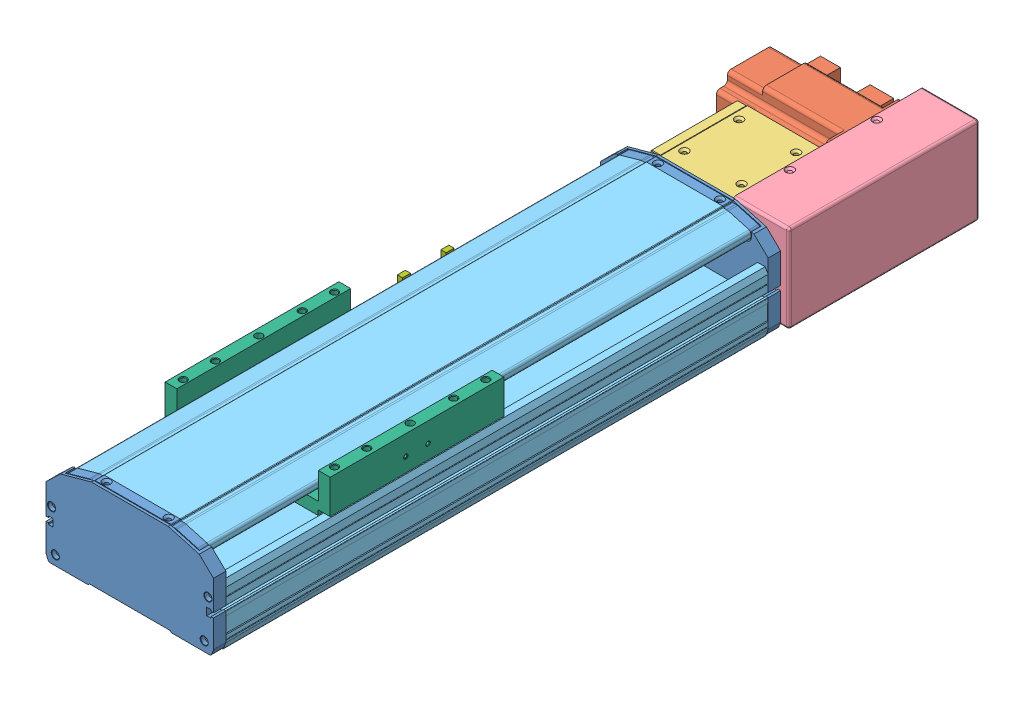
SolidWorks assembly TCD135-T-J3BL-0.SLDASM, configuration 150 (file format 9000). Lengths in mm.
Overall size (155.15 78 615.8).
10 component instances, 7 part files, 28 mates.
Components (placement in the parent):
- TCD135-T-J3BL-5-1: TCD135-T-J3BL-5.SLDPRT [默认] at origin
- TCD135-T-J3BL-2-1: TCD135-T-J3BL-2.SLDPRT [默认] at (22.25 37.15 -111.8) x (0 0 1) z (-1 0 0)
- TCD135-T-J3BL-4-1: TCD135-T-J3BL-4.SLDPRT [默认] at (29.25 36.9 -35) x (0 1 0) z (-1 0 0)
- TCD135-T-J3BL-6-1: TCD135-T-J3BL-6.SLDPRT [默认] at (29.25 37.15 -76.75) x (0 0 1) z (1 0 0)
- TCD135-T-J3BL-5-2: TCD135-T-J3BL-5.SLDPRT [默认] at (0 0 457) x (-1 0 0) z (0 0 -1)
- TCD135-T-J3BL-1-2: TCD135-T-J3BL-1.SLDPRT [150] at (0 0 10) x (-1 0 0) z (0 0 -1) size (135 73.5 437)
- TCD135-T-J3BL-3-1: TCD135-T-J3BL-3.sldprt [默认] at (0 33.9 292)
- TCD135-T-J3BL-7-1: TCD135-T-J3BL-7.sldprt [默认] at (-11 -5.2004 265.6996) x (-1 0 0) z (0 0 -1)
- TCD135-T-J3BL-7-2: TCD135-T-J3BL-7.sldprt [默认] at (-11 -5.2004 435.2996) x (-1 0 0) z (0 0 -1)
- TCD135-T-J3BL-7-3: TCD135-T-J3BL-7.sldprt [默认] at (-11 -5.2004 300.6996) x (-1 0 0) z (0 0 -1)
Mates (geometry in assembly coordinates):
- 重合1: coincident anti-aligned: plane of TCD135-T-J3BL-2-1 through (29.25 10.15 -84.8) normal (1 0 0); plane of TCD135-T-J3BL-6-1 through (29.25 37.15 -76.75) normal (-1 0 0)
- 距离1: distance = 11.7 mm aligned: plane of TCD135-T-J3BL-2-1 through (-69.15 52.15 -141.8) normal (0 0 -1); plane of TCD135-T-J3BL-6-1 through (74.25 72.4 -153.5) normal (0 0 -1)
- 距离2: distance = 5.25 mm aligned: plane of TCD135-T-J3BL-2-1 through (-69.15 7.15 -126.8) normal (0 -1 0); plane of TCD135-T-J3BL-6-1 through (74.25 1.9 -153.5) normal (0 -1 0)
- 重合2: coincident aligned: plane of TCD135-T-J3BL-4-1 through (-29.25 1.9 0) normal (0 0 1); plane of TCD135-T-J3BL-6-1 through (74.25 72.4 0) normal (0 0 1)
- 重合4: coincident anti-aligned: plane of TCD135-T-J3BL-4-1 through (29.25 36.9 -35) normal (1 0 0); plane of TCD135-T-J3BL-6-1 through (29.25 37.15 -76.75) normal (-1 0 0)
- 重合6: coincident anti-aligned: plane of TCD135-T-J3BL-5-1 through (64.1333 0.9 0) normal (0 0 -1); plane of TCD135-T-J3BL-4-1 through (-29.25 1.9 0) normal (0 0 1)
- 重合17: coincident aligned: plane of TCD135-T-J3BL-4-1 through (-29.25 1.9 0) normal (0 -1 0); plane of TCD135-T-J3BL-6-1 through (74.25 1.9 -153.5) normal (0 -1 0)
- LimitDistance1: limit distance = 292 mm aligned: plane of TCD135-T-J3BL-4-1 through (-29.25 1.9 -70) normal (0 0 -1); plane of TCD135-T-J3BL-3-1 through (0 60.65 222) normal (0 0 -1)
- LimitDistance2: limit distance = 95 mm aligned: plane of TCD135-T-J3BL-3-1 through (0 60.65 362) normal (0 0 1); plane of TCD135-T-J3BL-5-2 through (-64.1333 0.9 457) normal (0 0 1)
- 重合18: coincident anti-aligned: plane of TCD135-T-J3BL-5-1 through (64.1333 0.9 10) normal (0 0 1); plane of TCD135-T-J3BL-1-2 through (67.5 6 10) normal (0 0 -1)
- 重合19: coincident aligned: plane of TCD135-T-J3BL-5-1 through (30.5 71.9 -105.7277) normal (0 1 0); plane of TCD135-T-J3BL-1-2 through (-30.5 71.9 447) normal (0 1 0)
- 重合20: coincident aligned: plane of TCD135-T-J3BL-5-1 through (-67.5 29.8 10) normal (-1 0 0); plane of TCD135-T-J3BL-1-2 through (-67.5 22.5 447) normal (-1 0 0)
- 重合21: coincident aligned: plane of TCD135-T-J3BL-5-2 through (-67.5 29.8 447) normal (-1 0 0); plane of TCD135-T-J3BL-1-2 through (-67.5 30.1 447) normal (-1 0 0)
- 重合22: coincident aligned: plane of TCD135-T-J3BL-5-2 through (-30.5 71.9 562.7277) normal (0 1 0); plane of TCD135-T-J3BL-1-2 through (-30.5 71.9 447) normal (0 1 0)
- 重合23: coincident anti-aligned: plane of TCD135-T-J3BL-5-2 through (-64.1333 0.9 447) normal (0 0 -1); plane of TCD135-T-J3BL-1-2 through (67.5 6 447) normal (0 0 1)
- 距离9: distance = 0.5 mm aligned: plane of TCD135-T-J3BL-3-1 through (-66.5 62.65 292) normal (-1 0 0); plane of TCD135-T-J3BL-1-2 through (-67 10 447) normal (-1 0 0)
- 距离10: distance = 78 mm anti-aligned: plane of TCD135-T-J3BL-3-1 through (-61.75 76.4 292) normal (0 1 0); plane of TCD135-T-J3BL-1-2 through (-34.1 -1.6 447) normal (0 -1 0)
- 重合24: coincident aligned: plane of TCD135-T-J3BL-5-1 through (31 71.9 10) normal (0 1 0); plane of TCD135-T-J3BL-4-1 through (-29.25 71.9 0) normal (0 1 0)
- 距离11: distance = 30.25 mm aligned: plane of TCD135-T-J3BL-4-1 through (-37.25 36.9 -35) normal (-1 0 0); plane of TCD135-T-J3BL-5-1 through (-67.5 29.8 10) normal (-1 0 0)
- 重合25: coincident anti-aligned: plane of TCD135-T-J3BL-1-2 through (-67.5 22.5 447) normal (-1 0 0); plane of TCD135-T-J3BL-7-1 through (-67.5 17 109.2) normal (1 0 0)
- 重合26: coincident aligned: plane of TCD135-T-J3BL-1-2 through (-67.2 26.2 447) normal (0 1 0); plane of TCD135-T-J3BL-7-1 through (-67.5 26.2 112.6633) normal (0 1 0)
- 重合27: coincident anti-aligned: plane of TCD135-T-J3BL-1-2 through (-67.5 22.5 447) normal (-1 0 0); plane of TCD135-T-J3BL-7-2 through (-67.5 17 278.8) normal (1 0 0)
- 重合28: coincident aligned: plane of TCD135-T-J3BL-1-2 through (-67.2 26.2 447) normal (0 1 0); plane of TCD135-T-J3BL-7-2 through (-67.5 26.2 282.2633) normal (0 1 0)
- 重合29: coincident anti-aligned: plane of TCD135-T-J3BL-1-2 through (-67.5 22.5 447) normal (-1 0 0); plane of TCD135-T-J3BL-7-3 through (-67.5 17 144.2) normal (1 0 0)
- 重合30: coincident aligned: plane of TCD135-T-J3BL-1-2 through (-67.2 26.2 447) normal (0 1 0); plane of TCD135-T-J3BL-7-3 through (-67.5 26.2 147.6633) normal (0 1 0)
- 距离12: distance = 35 mm aligned: plane of TCD135-T-J3BL-7-3 through (-67.5 17 154) normal (0 0 -1); plane of TCD135-T-J3BL-7-1 through (-67.5 17 119) normal (0 0 -1)
- 距离13: distance = 119 mm aligned: plane of TCD135-T-J3BL-7-1 through (-67.5 17 119) normal (0 0 -1); plane of TCD135-T-J3BL-5-1 through (64.1333 0.9 0) normal (0 0 -1)
- 距离14: distance = 162 mm aligned: plane of TCD135-T-J3BL-7-2 through (-67.5 17 295) normal (0 0 1); plane of TCD135-T-J3BL-5-2 through (-64.1333 0.9 457) normal (0 0 1)
